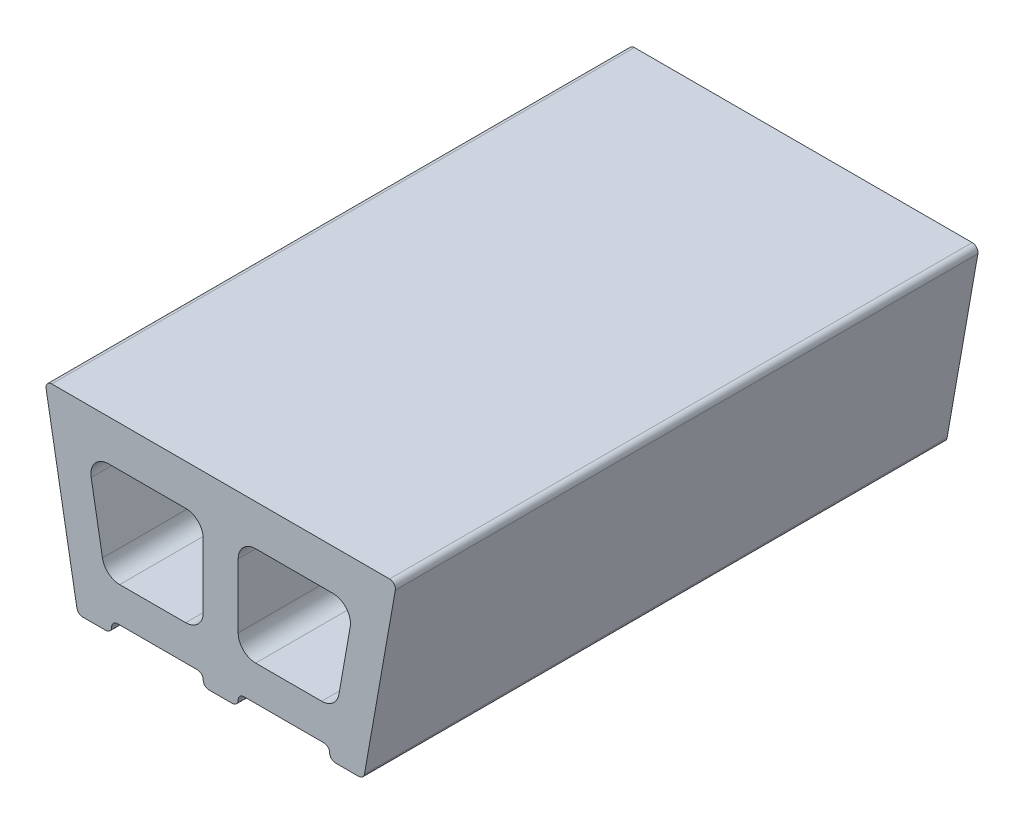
ISO-10303-21;
HEADER;
FILE_DESCRIPTION(('STEP AP214'),'2;1');
FILE_NAME('part.step','',(''),(''),'','','');
FILE_SCHEMA(('AUTOMOTIVE_DESIGN { 1 0 10303 214 1 1 1 1 }'));
ENDSEC;
DATA;
#1=APPLICATION_CONTEXT('core data for automotive mechanical design processes');
#2=APPLICATION_PROTOCOL_DEFINITION('international standard','automotive_design',2000,#1);
#3=PRODUCT_CONTEXT('',#1,'mechanical');
#4=PRODUCT('Part','Part','',(#3));
#5=PRODUCT_RELATED_PRODUCT_CATEGORY('part','',(#4));
#6=PRODUCT_DEFINITION_FORMATION('','',#4);
#7=PRODUCT_DEFINITION_CONTEXT('part definition',#1,'design');
#8=PRODUCT_DEFINITION('design','',#6,#7);
#9=PRODUCT_DEFINITION_SHAPE('','',#8);
#10=(LENGTH_UNIT() NAMED_UNIT(*) SI_UNIT(.MILLI.,.METRE.));
#11=(NAMED_UNIT(*) PLANE_ANGLE_UNIT() SI_UNIT($,.RADIAN.));
#12=(NAMED_UNIT(*) SI_UNIT($,.STERADIAN.) SOLID_ANGLE_UNIT());
#13=UNCERTAINTY_MEASURE_WITH_UNIT(LENGTH_MEASURE(1.E-05),#10,'distance_accuracy_value','');
#14=(GEOMETRIC_REPRESENTATION_CONTEXT(3) GLOBAL_UNCERTAINTY_ASSIGNED_CONTEXT((#13)) GLOBAL_UNIT_ASSIGNED_CONTEXT((#10,
#11,#12)) REPRESENTATION_CONTEXT('',''));
#15=CARTESIAN_POINT('',(0.,0.,0.));
#16=DIRECTION('',(0.,0.,1.));
#17=DIRECTION('',(1.,0.,0.));
#18=AXIS2_PLACEMENT_3D('',#15,#16,#17);
#19=CARTESIAN_POINT('',(0.,0.,500.));
#20=DIRECTION('',(0.,0.,-1.));
#21=DIRECTION('',(-1.,0.,0.));
#22=AXIS2_PLACEMENT_3D('',#19,#20,#21);
#23=PLANE('',#22);
#24=DIRECTION('',(1.,0.,0.));
#25=VECTOR('',#24,1.);
#26=CARTESIAN_POINT('',(93.5509528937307,-5.,500.));
#27=LINE('',#26,#25);
#28=CARTESIAN_POINT('',(98.5509528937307,-5.,500.));
#29=VERTEX_POINT('',#28);
#30=CARTESIAN_POINT('',(118.473819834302,-5.,500.));
#31=VERTEX_POINT('',#30);
#32=EDGE_CURVE('E519',#29,#31,#27,.T.);
#33=ORIENTED_EDGE('',*,*,#32,.T.);
#34=CARTESIAN_POINT('',(118.473819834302,0.,500.));
#35=DIRECTION('',(0.,0.,-1.));
#36=DIRECTION('',(-1.,0.,0.));
#37=AXIS2_PLACEMENT_3D('',#34,#35,#36);
#38=CIRCLE('',#37,5.);
#39=CARTESIAN_POINT('',(123.397858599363,-0.86824088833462,500.));
#40=VERTEX_POINT('',#39);
#41=EDGE_CURVE('E58',#31,#40,#38,.F.);
#42=ORIENTED_EDGE('',*,*,#41,.T.);
#43=DIRECTION('',(0.173648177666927,0.984807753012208,0.));
#44=VECTOR('',#43,1.);
#45=CARTESIAN_POINT('',(150.,150.,500.));
#46=LINE('',#45,#44);
#47=CARTESIAN_POINT('',(149.846905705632,149.131759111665,500.));
#48=VERTEX_POINT('',#47);
#49=EDGE_CURVE('E363',#40,#48,#46,.T.);
#50=ORIENTED_EDGE('',*,*,#49,.T.);
#51=CARTESIAN_POINT('',(144.922866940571,150.,500.));
#52=DIRECTION('',(0.,0.,-1.));
#53=DIRECTION('',(-1.,0.,0.));
#54=AXIS2_PLACEMENT_3D('',#51,#52,#53);
#55=CIRCLE('',#54,5.);
#56=CARTESIAN_POINT('',(144.922866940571,155.,500.));
#57=VERTEX_POINT('',#56);
#58=EDGE_CURVE('E467',#48,#57,#55,.F.);
#59=ORIENTED_EDGE('',*,*,#58,.T.);
#60=DIRECTION('',(-1.,0.,0.));
#61=VECTOR('',#60,1.);
#62=CARTESIAN_POINT('',(-150.881634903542,155.,500.));
#63=LINE('',#62,#61);
#64=CARTESIAN_POINT('',(-144.922866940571,155.,500.));
#65=VERTEX_POINT('',#64);
#66=EDGE_CURVE('E537',#57,#65,#63,.T.);
#67=ORIENTED_EDGE('',*,*,#66,.T.);
#68=CARTESIAN_POINT('',(-144.922866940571,150.,500.));
#69=DIRECTION('',(0.,0.,-1.));
#70=DIRECTION('',(-1.,0.,0.));
#71=AXIS2_PLACEMENT_3D('',#68,#69,#70);
#72=CIRCLE('',#71,5.);
#73=CARTESIAN_POINT('',(-149.846905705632,149.131759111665,500.));
#74=VERTEX_POINT('',#73);
#75=EDGE_CURVE('E465',#65,#74,#72,.F.);
#76=ORIENTED_EDGE('',*,*,#75,.T.);
#77=DIRECTION('',(0.173648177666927,-0.984807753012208,0.));
#78=VECTOR('',#77,1.);
#79=CARTESIAN_POINT('',(-123.550952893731,0.,500.));
#80=LINE('',#79,#78);
#81=CARTESIAN_POINT('',(-123.397858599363,-0.868240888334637,500.));
#82=VERTEX_POINT('',#81);
#83=EDGE_CURVE('E360',#74,#82,#80,.T.);
#84=ORIENTED_EDGE('',*,*,#83,.T.);
#85=CARTESIAN_POINT('',(-118.473819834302,0.,500.));
#86=DIRECTION('',(0.,0.,-1.));
#87=DIRECTION('',(-1.,0.,0.));
#88=AXIS2_PLACEMENT_3D('',#85,#86,#87);
#89=CIRCLE('',#88,5.);
#90=CARTESIAN_POINT('',(-118.473819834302,-5.,500.));
#91=VERTEX_POINT('',#90);
#92=EDGE_CURVE('E486',#82,#91,#89,.F.);
#93=ORIENTED_EDGE('',*,*,#92,.T.);
#94=DIRECTION('',(1.,0.,0.));
#95=VECTOR('',#94,1.);
#96=CARTESIAN_POINT('',(-122.669317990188,-5.,500.));
#97=LINE('',#96,#95);
#98=CARTESIAN_POINT('',(-98.5509528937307,-5.,500.));
#99=VERTEX_POINT('',#98);
#100=EDGE_CURVE('E531',#91,#99,#97,.T.);
#101=ORIENTED_EDGE('',*,*,#100,.T.);
#102=CARTESIAN_POINT('',(-98.5509528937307,0.,500.));
#103=DIRECTION('',(0.,0.,-1.));
#104=DIRECTION('',(-1.,0.,0.));
#105=AXIS2_PLACEMENT_3D('',#102,#103,#104);
#106=CIRCLE('',#105,5.);
#107=CARTESIAN_POINT('',(-93.5509528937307,0.,500.));
#108=VERTEX_POINT('',#107);
#109=EDGE_CURVE('E488',#99,#108,#106,.F.);
#110=ORIENTED_EDGE('',*,*,#109,.T.);
#111=CARTESIAN_POINT('',(-88.5509528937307,0.,500.));
#112=DIRECTION('',(0.,0.,-1.));
#113=DIRECTION('',(-1.,0.,0.));
#114=AXIS2_PLACEMENT_3D('',#111,#112,#113);
#115=CIRCLE('',#114,5.);
#116=CARTESIAN_POINT('',(-88.5509528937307,4.99999999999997,500.));
#117=VERTEX_POINT('',#116);
#118=EDGE_CURVE('E458',#108,#117,#115,.T.);
#119=ORIENTED_EDGE('',*,*,#118,.T.);
#120=DIRECTION('',(-1.,0.,0.));
#121=VECTOR('',#120,1.);
#122=CARTESIAN_POINT('',(-93.5509528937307,4.99999999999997,500.));
#123=LINE('',#122,#121);
#124=CARTESIAN_POINT('',(-20.,4.99999999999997,500.));
#125=VERTEX_POINT('',#124);
#126=EDGE_CURVE('E290',#125,#117,#123,.T.);
#127=ORIENTED_EDGE('',*,*,#126,.F.);
#128=CARTESIAN_POINT('',(-20.,0.,500.));
#129=DIRECTION('',(0.,0.,-1.));
#130=DIRECTION('',(-1.,0.,0.));
#131=AXIS2_PLACEMENT_3D('',#128,#129,#130);
#132=CIRCLE('',#131,5.);
#133=CARTESIAN_POINT('',(-15.,0.,500.));
#134=VERTEX_POINT('',#133);
#135=EDGE_CURVE('E453',#125,#134,#132,.T.);
#136=ORIENTED_EDGE('',*,*,#135,.T.);
#137=CARTESIAN_POINT('',(-10.,0.,500.));
#138=DIRECTION('',(0.,0.,-1.));
#139=DIRECTION('',(-1.,0.,0.));
#140=AXIS2_PLACEMENT_3D('',#137,#138,#139);
#141=CIRCLE('',#140,5.);
#142=CARTESIAN_POINT('',(-10.,-5.,500.));
#143=VERTEX_POINT('',#142);
#144=EDGE_CURVE('E502',#134,#143,#141,.F.);
#145=ORIENTED_EDGE('',*,*,#144,.T.);
#146=DIRECTION('',(1.,0.,0.));
#147=VECTOR('',#146,1.);
#148=CARTESIAN_POINT('',(-15.,-5.,500.));
#149=LINE('',#148,#147);
#150=CARTESIAN_POINT('',(10.,-5.,500.));
#151=VERTEX_POINT('',#150);
#152=EDGE_CURVE('E525',#143,#151,#149,.T.);
#153=ORIENTED_EDGE('',*,*,#152,.T.);
#154=CARTESIAN_POINT('',(10.,0.,500.));
#155=DIRECTION('',(0.,0.,-1.));
#156=DIRECTION('',(-1.,0.,0.));
#157=AXIS2_PLACEMENT_3D('',#154,#155,#156);
#158=CIRCLE('',#157,5.);
#159=CARTESIAN_POINT('',(15.,0.,500.));
#160=VERTEX_POINT('',#159);
#161=EDGE_CURVE('E504',#151,#160,#158,.F.);
#162=ORIENTED_EDGE('',*,*,#161,.T.);
#163=CARTESIAN_POINT('',(20.,0.,500.));
#164=DIRECTION('',(0.,0.,-1.));
#165=DIRECTION('',(-1.,0.,0.));
#166=AXIS2_PLACEMENT_3D('',#163,#164,#165);
#167=CIRCLE('',#166,5.);
#168=CARTESIAN_POINT('',(20.,4.99999999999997,500.));
#169=VERTEX_POINT('',#168);
#170=EDGE_CURVE('E285',#160,#169,#167,.T.);
#171=ORIENTED_EDGE('',*,*,#170,.T.);
#172=DIRECTION('',(-1.,0.,0.));
#173=VECTOR('',#172,1.);
#174=CARTESIAN_POINT('',(15.,4.99999999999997,500.));
#175=LINE('',#174,#173);
#176=CARTESIAN_POINT('',(88.5509528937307,4.99999999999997,500.));
#177=VERTEX_POINT('',#176);
#178=EDGE_CURVE('E300',#177,#169,#175,.T.);
#179=ORIENTED_EDGE('',*,*,#178,.F.);
#180=CARTESIAN_POINT('',(88.5509528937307,0.,500.));
#181=DIRECTION('',(0.,0.,-1.));
#182=DIRECTION('',(-1.,0.,0.));
#183=AXIS2_PLACEMENT_3D('',#180,#181,#182);
#184=CIRCLE('',#183,5.);
#185=CARTESIAN_POINT('',(93.5509528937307,0.,500.));
#186=VERTEX_POINT('',#185);
#187=EDGE_CURVE('E286',#177,#186,#184,.T.);
#188=ORIENTED_EDGE('',*,*,#187,.T.);
#189=CARTESIAN_POINT('',(98.5509528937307,0.,500.));
#190=DIRECTION('',(0.,0.,-1.));
#191=DIRECTION('',(-1.,0.,0.));
#192=AXIS2_PLACEMENT_3D('',#189,#190,#191);
#193=CIRCLE('',#192,5.);
#194=EDGE_CURVE('E288',#186,#29,#193,.F.);
#195=ORIENTED_EDGE('',*,*,#194,.T.);
#196=EDGE_LOOP('',(#33,#42,#50,#59,#67,#76,#84,#93,#101,#110,#119,#127,#136,#145,#153,#162,#171,
#179,#188,#195));
#197=FACE_BOUND('',#196,.T.);
#198=DIRECTION('',(1.,0.,0.));
#199=VECTOR('',#198,1.);
#200=CARTESIAN_POINT('',(-99.2595988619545,35.,500.));
#201=LINE('',#200,#199);
#202=CARTESIAN_POINT('',(-86.6731043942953,35.,500.));
#203=VERTEX_POINT('',#202);
#204=CARTESIAN_POINT('',(-30.,35.,500.));
#205=VERTEX_POINT('',#204);
#206=EDGE_CURVE('E352',#203,#205,#201,.T.);
#207=ORIENTED_EDGE('',*,*,#206,.F.);
#208=CARTESIAN_POINT('',(-86.6731043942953,50.,500.));
#209=DIRECTION('',(0.,0.,-1.));
#210=DIRECTION('',(-1.,0.,0.));
#211=AXIS2_PLACEMENT_3D('',#208,#209,#210);
#212=CIRCLE('',#211,15.);
#213=CARTESIAN_POINT('',(-101.445220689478,47.3952773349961,500.));
#214=VERTEX_POINT('',#213);
#215=EDGE_CURVE('E425',#203,#214,#212,.T.);
#216=ORIENTED_EDGE('',*,*,#215,.T.);
#217=DIRECTION('',(0.173648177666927,-0.984807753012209,0.));
#218=VECTOR('',#217,1.);
#219=CARTESIAN_POINT('',(-114.247392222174,120.,500.));
#220=LINE('',#219,#218);
#221=CARTESIAN_POINT('',(-111.143204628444,102.395277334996,500.));
#222=VERTEX_POINT('',#221);
#223=EDGE_CURVE('E325',#222,#214,#220,.T.);
#224=ORIENTED_EDGE('',*,*,#223,.F.);
#225=CARTESIAN_POINT('',(-96.3710883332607,105.,500.));
#226=DIRECTION('',(0.,0.,-1.));
#227=DIRECTION('',(-1.,0.,0.));
#228=AXIS2_PLACEMENT_3D('',#225,#226,#227);
#229=CIRCLE('',#228,15.);
#230=CARTESIAN_POINT('',(-96.3710883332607,120.,500.));
#231=VERTEX_POINT('',#230);
#232=EDGE_CURVE('E437',#222,#231,#229,.T.);
#233=ORIENTED_EDGE('',*,*,#232,.T.);
#234=DIRECTION('',(-1.,0.,0.));
#235=VECTOR('',#234,1.);
#236=CARTESIAN_POINT('',(-114.247392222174,120.,500.));
#237=LINE('',#236,#235);
#238=CARTESIAN_POINT('',(-30.,120.,500.));
#239=VERTEX_POINT('',#238);
#240=EDGE_CURVE('E340',#239,#231,#237,.T.);
#241=ORIENTED_EDGE('',*,*,#240,.F.);
#242=CARTESIAN_POINT('',(-30.,105.,500.));
#243=DIRECTION('',(0.,0.,-1.));
#244=DIRECTION('',(-1.,0.,0.));
#245=AXIS2_PLACEMENT_3D('',#242,#243,#244);
#246=CIRCLE('',#245,15.);
#247=CARTESIAN_POINT('',(-15.,105.,500.));
#248=VERTEX_POINT('',#247);
#249=EDGE_CURVE('E433',#239,#248,#246,.T.);
#250=ORIENTED_EDGE('',*,*,#249,.T.);
#251=DIRECTION('',(0.,1.,0.));
#252=VECTOR('',#251,1.);
#253=CARTESIAN_POINT('',(-15.,120.,500.));
#254=LINE('',#253,#252);
#255=CARTESIAN_POINT('',(-15.,50.,500.));
#256=VERTEX_POINT('',#255);
#257=EDGE_CURVE('E355',#256,#248,#254,.T.);
#258=ORIENTED_EDGE('',*,*,#257,.F.);
#259=CARTESIAN_POINT('',(-30.,50.,500.));
#260=DIRECTION('',(0.,0.,-1.));
#261=DIRECTION('',(-1.,0.,0.));
#262=AXIS2_PLACEMENT_3D('',#259,#260,#261);
#263=CIRCLE('',#262,15.);
#264=EDGE_CURVE('E429',#256,#205,#263,.T.);
#265=ORIENTED_EDGE('',*,*,#264,.T.);
#266=EDGE_LOOP('',(#207,#216,#224,#233,#241,#250,#258,#265));
#267=FACE_BOUND('',#266,.T.);
#268=DIRECTION('',(1.,0.,0.));
#269=VECTOR('',#268,1.);
#270=CARTESIAN_POINT('',(114.247392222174,120.,500.));
#271=LINE('',#270,#269);
#272=CARTESIAN_POINT('',(30.,120.,500.));
#273=VERTEX_POINT('',#272);
#274=CARTESIAN_POINT('',(96.3710883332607,120.,500.));
#275=VERTEX_POINT('',#274);
#276=EDGE_CURVE('E328',#273,#275,#271,.T.);
#277=ORIENTED_EDGE('',*,*,#276,.T.);
#278=CARTESIAN_POINT('',(96.3710883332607,105.,500.));
#279=DIRECTION('',(0.,0.,-1.));
#280=DIRECTION('',(-1.,0.,0.));
#281=AXIS2_PLACEMENT_3D('',#278,#279,#280);
#282=CIRCLE('',#281,15.);
#283=CARTESIAN_POINT('',(111.143204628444,102.395277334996,500.));
#284=VERTEX_POINT('',#283);
#285=EDGE_CURVE('E417',#275,#284,#282,.T.);
#286=ORIENTED_EDGE('',*,*,#285,.T.);
#287=DIRECTION('',(-0.173648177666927,-0.984807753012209,0.));
#288=VECTOR('',#287,1.);
#289=CARTESIAN_POINT('',(114.247392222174,120.,500.));
#290=LINE('',#289,#288);
#291=CARTESIAN_POINT('',(101.445220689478,47.3952773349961,500.));
#292=VERTEX_POINT('',#291);
#293=EDGE_CURVE('E309',#284,#292,#290,.T.);
#294=ORIENTED_EDGE('',*,*,#293,.T.);
#295=CARTESIAN_POINT('',(86.6731043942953,50.,500.));
#296=DIRECTION('',(0.,0.,-1.));
#297=DIRECTION('',(-1.,0.,0.));
#298=AXIS2_PLACEMENT_3D('',#295,#296,#297);
#299=CIRCLE('',#298,15.);
#300=CARTESIAN_POINT('',(86.6731043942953,35.,500.));
#301=VERTEX_POINT('',#300);
#302=EDGE_CURVE('E413',#292,#301,#299,.T.);
#303=ORIENTED_EDGE('',*,*,#302,.T.);
#304=DIRECTION('',(-1.,0.,0.));
#305=VECTOR('',#304,1.);
#306=CARTESIAN_POINT('',(99.2595988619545,35.,500.));
#307=LINE('',#306,#305);
#308=CARTESIAN_POINT('',(30.,35.,500.));
#309=VERTEX_POINT('',#308);
#310=EDGE_CURVE('E316',#301,#309,#307,.T.);
#311=ORIENTED_EDGE('',*,*,#310,.T.);
#312=CARTESIAN_POINT('',(30.,50.,500.));
#313=DIRECTION('',(0.,0.,-1.));
#314=DIRECTION('',(-1.,0.,0.));
#315=AXIS2_PLACEMENT_3D('',#312,#313,#314);
#316=CIRCLE('',#315,15.);
#317=CARTESIAN_POINT('',(15.,50.,500.));
#318=VERTEX_POINT('',#317);
#319=EDGE_CURVE('E409',#309,#318,#316,.T.);
#320=ORIENTED_EDGE('',*,*,#319,.T.);
#321=DIRECTION('',(0.,1.,0.));
#322=VECTOR('',#321,1.);
#323=CARTESIAN_POINT('',(15.,120.,500.));
#324=LINE('',#323,#322);
#325=CARTESIAN_POINT('',(15.,105.,500.));
#326=VERTEX_POINT('',#325);
#327=EDGE_CURVE('E331',#318,#326,#324,.T.);
#328=ORIENTED_EDGE('',*,*,#327,.T.);
#329=CARTESIAN_POINT('',(30.,105.,500.));
#330=DIRECTION('',(0.,0.,-1.));
#331=DIRECTION('',(-1.,0.,0.));
#332=AXIS2_PLACEMENT_3D('',#329,#330,#331);
#333=CIRCLE('',#332,15.);
#334=EDGE_CURVE('E421',#326,#273,#333,.T.);
#335=ORIENTED_EDGE('',*,*,#334,.T.);
#336=EDGE_LOOP('',(#277,#286,#294,#303,#311,#320,#328,#335));
#337=FACE_BOUND('',#336,.T.);
#338=ADVANCED_FACE('F35',(#197,#267,#337),#23,.F.);
#339=CARTESIAN_POINT('',(0.,0.,0.));
#340=DIRECTION('',(0.,0.,-1.));
#341=DIRECTION('',(-1.,0.,0.));
#342=AXIS2_PLACEMENT_3D('',#339,#340,#341);
#343=PLANE('',#342);
#344=DIRECTION('',(0.173648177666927,0.984807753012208,0.));
#345=VECTOR('',#344,1.);
#346=CARTESIAN_POINT('',(150.,150.,0.));
#347=LINE('',#346,#345);
#348=CARTESIAN_POINT('',(123.397858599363,-0.86824088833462,0.));
#349=VERTEX_POINT('',#348);
#350=CARTESIAN_POINT('',(149.846905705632,149.131759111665,0.));
#351=VERTEX_POINT('',#350);
#352=EDGE_CURVE('E364',#349,#351,#347,.T.);
#353=ORIENTED_EDGE('',*,*,#352,.F.);
#354=CARTESIAN_POINT('',(118.473819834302,0.,0.));
#355=DIRECTION('',(0.,0.,-1.));
#356=DIRECTION('',(-1.,0.,0.));
#357=AXIS2_PLACEMENT_3D('',#354,#355,#356);
#358=CIRCLE('',#357,5.);
#359=CARTESIAN_POINT('',(118.473819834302,-5.,0.));
#360=VERTEX_POINT('',#359);
#361=EDGE_CURVE('E11',#349,#360,#358,.T.);
#362=ORIENTED_EDGE('',*,*,#361,.T.);
#363=DIRECTION('',(1.,0.,0.));
#364=VECTOR('',#363,1.);
#365=CARTESIAN_POINT('',(93.5509528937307,-5.,0.));
#366=LINE('',#365,#364);
#367=CARTESIAN_POINT('',(98.5509528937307,-5.,0.));
#368=VERTEX_POINT('',#367);
#369=EDGE_CURVE('E274',#368,#360,#366,.T.);
#370=ORIENTED_EDGE('',*,*,#369,.F.);
#371=CARTESIAN_POINT('',(98.5509528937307,0.,0.));
#372=DIRECTION('',(0.,0.,-1.));
#373=DIRECTION('',(-1.,0.,0.));
#374=AXIS2_PLACEMENT_3D('',#371,#372,#373);
#375=CIRCLE('',#374,5.);
#376=CARTESIAN_POINT('',(93.5509528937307,0.,0.));
#377=VERTEX_POINT('',#376);
#378=EDGE_CURVE('E43',#368,#377,#375,.T.);
#379=ORIENTED_EDGE('',*,*,#378,.T.);
#380=CARTESIAN_POINT('',(88.5509528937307,0.,0.));
#381=DIRECTION('',(0.,0.,-1.));
#382=DIRECTION('',(-1.,0.,0.));
#383=AXIS2_PLACEMENT_3D('',#380,#381,#382);
#384=CIRCLE('',#383,5.);
#385=CARTESIAN_POINT('',(88.5509528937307,4.99999999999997,0.));
#386=VERTEX_POINT('',#385);
#387=EDGE_CURVE('E271',#377,#386,#384,.F.);
#388=ORIENTED_EDGE('',*,*,#387,.T.);
#389=DIRECTION('',(-1.,0.,0.));
#390=VECTOR('',#389,1.);
#391=CARTESIAN_POINT('',(15.,4.99999999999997,0.));
#392=LINE('',#391,#390);
#393=CARTESIAN_POINT('',(20.,4.99999999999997,0.));
#394=VERTEX_POINT('',#393);
#395=EDGE_CURVE('E297',#386,#394,#392,.T.);
#396=ORIENTED_EDGE('',*,*,#395,.T.);
#397=CARTESIAN_POINT('',(20.,0.,0.));
#398=DIRECTION('',(0.,0.,-1.));
#399=DIRECTION('',(-1.,0.,0.));
#400=AXIS2_PLACEMENT_3D('',#397,#398,#399);
#401=CIRCLE('',#400,5.);
#402=CARTESIAN_POINT('',(15.,0.,0.));
#403=VERTEX_POINT('',#402);
#404=EDGE_CURVE('E451',#394,#403,#401,.F.);
#405=ORIENTED_EDGE('',*,*,#404,.T.);
#406=CARTESIAN_POINT('',(10.,0.,0.));
#407=DIRECTION('',(0.,0.,-1.));
#408=DIRECTION('',(-1.,0.,0.));
#409=AXIS2_PLACEMENT_3D('',#406,#407,#408);
#410=CIRCLE('',#409,5.);
#411=CARTESIAN_POINT('',(10.,-5.,0.));
#412=VERTEX_POINT('',#411);
#413=EDGE_CURVE('E508',#403,#412,#410,.T.);
#414=ORIENTED_EDGE('',*,*,#413,.T.);
#415=DIRECTION('',(1.,0.,0.));
#416=VECTOR('',#415,1.);
#417=CARTESIAN_POINT('',(-15.,-5.,0.));
#418=LINE('',#417,#416);
#419=CARTESIAN_POINT('',(-10.,-5.,0.));
#420=VERTEX_POINT('',#419);
#421=EDGE_CURVE('E528',#420,#412,#418,.T.);
#422=ORIENTED_EDGE('',*,*,#421,.F.);
#423=CARTESIAN_POINT('',(-10.,0.,0.));
#424=DIRECTION('',(0.,0.,-1.));
#425=DIRECTION('',(-1.,0.,0.));
#426=AXIS2_PLACEMENT_3D('',#423,#424,#425);
#427=CIRCLE('',#426,5.);
#428=CARTESIAN_POINT('',(-15.,0.,0.));
#429=VERTEX_POINT('',#428);
#430=EDGE_CURVE('E506',#420,#429,#427,.T.);
#431=ORIENTED_EDGE('',*,*,#430,.T.);
#432=CARTESIAN_POINT('',(-20.,0.,0.));
#433=DIRECTION('',(0.,0.,-1.));
#434=DIRECTION('',(-1.,0.,0.));
#435=AXIS2_PLACEMENT_3D('',#432,#433,#434);
#436=CIRCLE('',#435,5.);
#437=CARTESIAN_POINT('',(-20.,4.99999999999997,0.));
#438=VERTEX_POINT('',#437);
#439=EDGE_CURVE('E456',#429,#438,#436,.F.);
#440=ORIENTED_EDGE('',*,*,#439,.T.);
#441=DIRECTION('',(-1.,0.,0.));
#442=VECTOR('',#441,1.);
#443=CARTESIAN_POINT('',(-93.5509528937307,4.99999999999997,0.));
#444=LINE('',#443,#442);
#445=CARTESIAN_POINT('',(-88.5509528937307,4.99999999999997,0.));
#446=VERTEX_POINT('',#445);
#447=EDGE_CURVE('E294',#438,#446,#444,.T.);
#448=ORIENTED_EDGE('',*,*,#447,.T.);
#449=CARTESIAN_POINT('',(-88.5509528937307,0.,0.));
#450=DIRECTION('',(0.,0.,-1.));
#451=DIRECTION('',(-1.,0.,0.));
#452=AXIS2_PLACEMENT_3D('',#449,#450,#451);
#453=CIRCLE('',#452,5.);
#454=CARTESIAN_POINT('',(-93.5509528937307,0.,0.));
#455=VERTEX_POINT('',#454);
#456=EDGE_CURVE('E460',#446,#455,#453,.F.);
#457=ORIENTED_EDGE('',*,*,#456,.T.);
#458=CARTESIAN_POINT('',(-98.5509528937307,0.,0.));
#459=DIRECTION('',(0.,0.,-1.));
#460=DIRECTION('',(-1.,0.,0.));
#461=AXIS2_PLACEMENT_3D('',#458,#459,#460);
#462=CIRCLE('',#461,5.);
#463=CARTESIAN_POINT('',(-98.5509528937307,-5.,0.));
#464=VERTEX_POINT('',#463);
#465=EDGE_CURVE('E492',#455,#464,#462,.T.);
#466=ORIENTED_EDGE('',*,*,#465,.T.);
#467=DIRECTION('',(1.,0.,0.));
#468=VECTOR('',#467,1.);
#469=CARTESIAN_POINT('',(-122.669317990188,-5.,0.));
#470=LINE('',#469,#468);
#471=CARTESIAN_POINT('',(-118.473819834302,-5.,0.));
#472=VERTEX_POINT('',#471);
#473=EDGE_CURVE('E534',#472,#464,#470,.T.);
#474=ORIENTED_EDGE('',*,*,#473,.F.);
#475=CARTESIAN_POINT('',(-118.473819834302,0.,0.));
#476=DIRECTION('',(0.,0.,-1.));
#477=DIRECTION('',(-1.,0.,0.));
#478=AXIS2_PLACEMENT_3D('',#475,#476,#477);
#479=CIRCLE('',#478,5.);
#480=CARTESIAN_POINT('',(-123.397858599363,-0.868240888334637,0.));
#481=VERTEX_POINT('',#480);
#482=EDGE_CURVE('E490',#472,#481,#479,.T.);
#483=ORIENTED_EDGE('',*,*,#482,.T.);
#484=DIRECTION('',(0.173648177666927,-0.984807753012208,0.));
#485=VECTOR('',#484,1.);
#486=CARTESIAN_POINT('',(-123.550952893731,0.,0.));
#487=LINE('',#486,#485);
#488=CARTESIAN_POINT('',(-149.846905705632,149.131759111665,0.));
#489=VERTEX_POINT('',#488);
#490=EDGE_CURVE('E349',#489,#481,#487,.T.);
#491=ORIENTED_EDGE('',*,*,#490,.F.);
#492=CARTESIAN_POINT('',(-144.922866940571,150.,0.));
#493=DIRECTION('',(0.,0.,-1.));
#494=DIRECTION('',(-1.,0.,0.));
#495=AXIS2_PLACEMENT_3D('',#492,#493,#494);
#496=CIRCLE('',#495,5.);
#497=CARTESIAN_POINT('',(-144.922866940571,155.,0.));
#498=VERTEX_POINT('',#497);
#499=EDGE_CURVE('E474',#489,#498,#496,.T.);
#500=ORIENTED_EDGE('',*,*,#499,.T.);
#501=DIRECTION('',(-1.,0.,0.));
#502=VECTOR('',#501,1.);
#503=CARTESIAN_POINT('',(-150.881634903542,155.,0.));
#504=LINE('',#503,#502);
#505=CARTESIAN_POINT('',(144.922866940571,155.,0.));
#506=VERTEX_POINT('',#505);
#507=EDGE_CURVE('E540',#506,#498,#504,.T.);
#508=ORIENTED_EDGE('',*,*,#507,.F.);
#509=CARTESIAN_POINT('',(144.922866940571,150.,0.));
#510=DIRECTION('',(0.,0.,-1.));
#511=DIRECTION('',(-1.,0.,0.));
#512=AXIS2_PLACEMENT_3D('',#509,#510,#511);
#513=CIRCLE('',#512,5.);
#514=EDGE_CURVE('E476',#506,#351,#513,.T.);
#515=ORIENTED_EDGE('',*,*,#514,.T.);
#516=EDGE_LOOP('',(#353,#362,#370,#379,#388,#396,#405,#414,#422,#431,#440,#448,#457,#466,#474,
#483,#491,#500,#508,#515));
#517=FACE_BOUND('',#516,.T.);
#518=DIRECTION('',(-1.,0.,0.));
#519=VECTOR('',#518,1.);
#520=CARTESIAN_POINT('',(-114.247392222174,120.,0.));
#521=LINE('',#520,#519);
#522=CARTESIAN_POINT('',(-30.,120.,0.));
#523=VERTEX_POINT('',#522);
#524=CARTESIAN_POINT('',(-96.3710883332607,120.,0.));
#525=VERTEX_POINT('',#524);
#526=EDGE_CURVE('E346',#523,#525,#521,.T.);
#527=ORIENTED_EDGE('',*,*,#526,.T.);
#528=CARTESIAN_POINT('',(-96.3710883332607,105.,0.));
#529=DIRECTION('',(0.,0.,-1.));
#530=DIRECTION('',(-1.,0.,0.));
#531=AXIS2_PLACEMENT_3D('',#528,#529,#530);
#532=CIRCLE('',#531,15.);
#533=CARTESIAN_POINT('',(-111.143204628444,102.395277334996,0.));
#534=VERTEX_POINT('',#533);
#535=EDGE_CURVE('E439',#525,#534,#532,.F.);
#536=ORIENTED_EDGE('',*,*,#535,.T.);
#537=DIRECTION('',(0.173648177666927,-0.984807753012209,0.));
#538=VECTOR('',#537,1.);
#539=CARTESIAN_POINT('',(-114.247392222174,120.,0.));
#540=LINE('',#539,#538);
#541=CARTESIAN_POINT('',(-101.445220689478,47.3952773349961,0.));
#542=VERTEX_POINT('',#541);
#543=EDGE_CURVE('E336',#534,#542,#540,.T.);
#544=ORIENTED_EDGE('',*,*,#543,.T.);
#545=CARTESIAN_POINT('',(-86.6731043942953,50.,0.));
#546=DIRECTION('',(0.,0.,-1.));
#547=DIRECTION('',(-1.,0.,0.));
#548=AXIS2_PLACEMENT_3D('',#545,#546,#547);
#549=CIRCLE('',#548,15.);
#550=CARTESIAN_POINT('',(-86.6731043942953,35.,0.));
#551=VERTEX_POINT('',#550);
#552=EDGE_CURVE('E427',#542,#551,#549,.F.);
#553=ORIENTED_EDGE('',*,*,#552,.T.);
#554=DIRECTION('',(1.,0.,0.));
#555=VECTOR('',#554,1.);
#556=CARTESIAN_POINT('',(-99.2595988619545,35.,0.));
#557=LINE('',#556,#555);
#558=CARTESIAN_POINT('',(-30.,35.,0.));
#559=VERTEX_POINT('',#558);
#560=EDGE_CURVE('E339',#551,#559,#557,.T.);
#561=ORIENTED_EDGE('',*,*,#560,.T.);
#562=CARTESIAN_POINT('',(-30.,50.,0.));
#563=DIRECTION('',(0.,0.,-1.));
#564=DIRECTION('',(-1.,0.,0.));
#565=AXIS2_PLACEMENT_3D('',#562,#563,#564);
#566=CIRCLE('',#565,15.);
#567=CARTESIAN_POINT('',(-15.,50.,0.));
#568=VERTEX_POINT('',#567);
#569=EDGE_CURVE('E431',#559,#568,#566,.F.);
#570=ORIENTED_EDGE('',*,*,#569,.T.);
#571=DIRECTION('',(0.,1.,0.));
#572=VECTOR('',#571,1.);
#573=CARTESIAN_POINT('',(-15.,120.,0.));
#574=LINE('',#573,#572);
#575=CARTESIAN_POINT('',(-15.,105.,0.));
#576=VERTEX_POINT('',#575);
#577=EDGE_CURVE('E343',#568,#576,#574,.T.);
#578=ORIENTED_EDGE('',*,*,#577,.T.);
#579=CARTESIAN_POINT('',(-30.,105.,0.));
#580=DIRECTION('',(0.,0.,-1.));
#581=DIRECTION('',(-1.,0.,0.));
#582=AXIS2_PLACEMENT_3D('',#579,#580,#581);
#583=CIRCLE('',#582,15.);
#584=EDGE_CURVE('E435',#576,#523,#583,.F.);
#585=ORIENTED_EDGE('',*,*,#584,.T.);
#586=EDGE_LOOP('',(#527,#536,#544,#553,#561,#570,#578,#585));
#587=FACE_BOUND('',#586,.T.);
#588=DIRECTION('',(-1.,0.,0.));
#589=VECTOR('',#588,1.);
#590=CARTESIAN_POINT('',(99.2595988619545,35.,0.));
#591=LINE('',#590,#589);
#592=CARTESIAN_POINT('',(86.6731043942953,35.,0.));
#593=VERTEX_POINT('',#592);
#594=CARTESIAN_POINT('',(30.,35.,0.));
#595=VERTEX_POINT('',#594);
#596=EDGE_CURVE('E322',#593,#595,#591,.T.);
#597=ORIENTED_EDGE('',*,*,#596,.F.);
#598=CARTESIAN_POINT('',(86.6731043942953,50.,0.));
#599=DIRECTION('',(0.,0.,-1.));
#600=DIRECTION('',(-1.,0.,0.));
#601=AXIS2_PLACEMENT_3D('',#598,#599,#600);
#602=CIRCLE('',#601,15.);
#603=CARTESIAN_POINT('',(101.445220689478,47.3952773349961,0.));
#604=VERTEX_POINT('',#603);
#605=EDGE_CURVE('E415',#593,#604,#602,.F.);
#606=ORIENTED_EDGE('',*,*,#605,.T.);
#607=DIRECTION('',(-0.173648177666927,-0.984807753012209,0.));
#608=VECTOR('',#607,1.);
#609=CARTESIAN_POINT('',(114.247392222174,120.,0.));
#610=LINE('',#609,#608);
#611=CARTESIAN_POINT('',(111.143204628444,102.395277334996,0.));
#612=VERTEX_POINT('',#611);
#613=EDGE_CURVE('E312',#612,#604,#610,.T.);
#614=ORIENTED_EDGE('',*,*,#613,.F.);
#615=CARTESIAN_POINT('',(96.3710883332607,105.,0.));
#616=DIRECTION('',(0.,0.,-1.));
#617=DIRECTION('',(-1.,0.,0.));
#618=AXIS2_PLACEMENT_3D('',#615,#616,#617);
#619=CIRCLE('',#618,15.);
#620=CARTESIAN_POINT('',(96.3710883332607,120.,0.));
#621=VERTEX_POINT('',#620);
#622=EDGE_CURVE('E419',#612,#621,#619,.F.);
#623=ORIENTED_EDGE('',*,*,#622,.T.);
#624=DIRECTION('',(1.,0.,0.));
#625=VECTOR('',#624,1.);
#626=CARTESIAN_POINT('',(114.247392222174,120.,0.));
#627=LINE('',#626,#625);
#628=CARTESIAN_POINT('',(30.,120.,0.));
#629=VERTEX_POINT('',#628);
#630=EDGE_CURVE('E315',#629,#621,#627,.T.);
#631=ORIENTED_EDGE('',*,*,#630,.F.);
#632=CARTESIAN_POINT('',(30.,105.,0.));
#633=DIRECTION('',(0.,0.,-1.));
#634=DIRECTION('',(-1.,0.,0.));
#635=AXIS2_PLACEMENT_3D('',#632,#633,#634);
#636=CIRCLE('',#635,15.);
#637=CARTESIAN_POINT('',(15.,105.,0.));
#638=VERTEX_POINT('',#637);
#639=EDGE_CURVE('E423',#629,#638,#636,.F.);
#640=ORIENTED_EDGE('',*,*,#639,.T.);
#641=DIRECTION('',(0.,1.,0.));
#642=VECTOR('',#641,1.);
#643=CARTESIAN_POINT('',(15.,120.,0.));
#644=LINE('',#643,#642);
#645=CARTESIAN_POINT('',(15.,50.,0.));
#646=VERTEX_POINT('',#645);
#647=EDGE_CURVE('E319',#646,#638,#644,.T.);
#648=ORIENTED_EDGE('',*,*,#647,.F.);
#649=CARTESIAN_POINT('',(30.,50.,0.));
#650=DIRECTION('',(0.,0.,-1.));
#651=DIRECTION('',(-1.,0.,0.));
#652=AXIS2_PLACEMENT_3D('',#649,#650,#651);
#653=CIRCLE('',#652,15.);
#654=EDGE_CURVE('E411',#646,#595,#653,.F.);
#655=ORIENTED_EDGE('',*,*,#654,.T.);
#656=EDGE_LOOP('',(#597,#606,#614,#623,#631,#640,#648,#655));
#657=FACE_BOUND('',#656,.T.);
#658=ADVANCED_FACE('F268',(#517,#587,#657),#343,.T.);
#659=CARTESIAN_POINT('',(-123.550952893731,0.,500.));
#660=DIRECTION('',(0.984807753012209,0.173648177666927,0.));
#661=DIRECTION('',(-0.173648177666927,0.984807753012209,0.));
#662=AXIS2_PLACEMENT_3D('',#659,#660,#661);
#663=PLANE('',#662);
#664=ORIENTED_EDGE('',*,*,#490,.T.);
#665=DIRECTION('',(0.,0.,1.));
#666=VECTOR('',#665,1.);
#667=CARTESIAN_POINT('',(-123.397858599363,-0.868240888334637,500.));
#668=LINE('',#667,#666);
#669=EDGE_CURVE('E494',#481,#82,#668,.T.);
#670=ORIENTED_EDGE('',*,*,#669,.T.);
#671=ORIENTED_EDGE('',*,*,#83,.F.);
#672=DIRECTION('',(0.,0.,1.));
#673=VECTOR('',#672,1.);
#674=CARTESIAN_POINT('',(-149.846905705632,149.131759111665,0.));
#675=LINE('',#674,#673);
#676=EDGE_CURVE('E479',#74,#489,#675,.F.);
#677=ORIENTED_EDGE('',*,*,#676,.T.);
#678=EDGE_LOOP('',(#664,#670,#671,#677));
#679=FACE_BOUND('',#678,.T.);
#680=ADVANCED_FACE('F596',(#679),#663,.F.);
#681=CARTESIAN_POINT('',(150.,150.,500.));
#682=DIRECTION('',(-0.984807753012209,0.173648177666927,0.));
#683=DIRECTION('',(-0.173648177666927,-0.984807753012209,0.));
#684=AXIS2_PLACEMENT_3D('',#681,#682,#683);
#685=PLANE('',#684);
#686=ORIENTED_EDGE('',*,*,#49,.F.);
#687=DIRECTION('',(0.,0.,1.));
#688=VECTOR('',#687,1.);
#689=CARTESIAN_POINT('',(123.397858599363,-0.868240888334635,0.));
#690=LINE('',#689,#688);
#691=EDGE_CURVE('E50',#40,#349,#690,.F.);
#692=ORIENTED_EDGE('',*,*,#691,.T.);
#693=ORIENTED_EDGE('',*,*,#352,.T.);
#694=DIRECTION('',(0.,0.,1.));
#695=VECTOR('',#694,1.);
#696=CARTESIAN_POINT('',(149.846905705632,149.131759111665,500.));
#697=LINE('',#696,#695);
#698=EDGE_CURVE('E462',#351,#48,#697,.T.);
#699=ORIENTED_EDGE('',*,*,#698,.T.);
#700=EDGE_LOOP('',(#686,#692,#693,#699));
#701=FACE_BOUND('',#700,.T.);
#702=ADVANCED_FACE('F631',(#701),#685,.F.);
#703=CARTESIAN_POINT('',(-114.247392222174,120.,0.));
#704=DIRECTION('',(-0.984807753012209,-0.173648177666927,0.));
#705=DIRECTION('',(0.173648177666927,-0.984807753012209,0.));
#706=AXIS2_PLACEMENT_3D('',#703,#704,#705);
#707=PLANE('',#706);
#708=ORIENTED_EDGE('',*,*,#223,.T.);
#709=DIRECTION('',(0.,0.,1.));
#710=VECTOR('',#709,1.);
#711=CARTESIAN_POINT('',(-101.445220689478,47.3952773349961,0.));
#712=LINE('',#711,#710);
#713=EDGE_CURVE('E397',#214,#542,#712,.F.);
#714=ORIENTED_EDGE('',*,*,#713,.T.);
#715=ORIENTED_EDGE('',*,*,#543,.F.);
#716=DIRECTION('',(0.,0.,1.));
#717=VECTOR('',#716,1.);
#718=CARTESIAN_POINT('',(-111.143204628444,102.395277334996,500.));
#719=LINE('',#718,#717);
#720=EDGE_CURVE('E394',#534,#222,#719,.T.);
#721=ORIENTED_EDGE('',*,*,#720,.T.);
#722=EDGE_LOOP('',(#708,#714,#715,#721));
#723=FACE_BOUND('',#722,.T.);
#724=ADVANCED_FACE('F628',(#723),#707,.F.);
#725=CARTESIAN_POINT('',(-114.247392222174,120.,0.));
#726=DIRECTION('',(0.,1.,0.));
#727=DIRECTION('',(0.,0.,1.));
#728=AXIS2_PLACEMENT_3D('',#725,#726,#727);
#729=PLANE('',#728);
#730=ORIENTED_EDGE('',*,*,#526,.F.);
#731=DIRECTION('',(0.,0.,1.));
#732=VECTOR('',#731,1.);
#733=CARTESIAN_POINT('',(-30.,120.,500.));
#734=LINE('',#733,#732);
#735=EDGE_CURVE('E406',#523,#239,#734,.T.);
#736=ORIENTED_EDGE('',*,*,#735,.T.);
#737=ORIENTED_EDGE('',*,*,#240,.T.);
#738=DIRECTION('',(0.,0.,1.));
#739=VECTOR('',#738,1.);
#740=CARTESIAN_POINT('',(-96.3710883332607,120.,0.));
#741=LINE('',#740,#739);
#742=EDGE_CURVE('E404',#231,#525,#741,.F.);
#743=ORIENTED_EDGE('',*,*,#742,.T.);
#744=EDGE_LOOP('',(#730,#736,#737,#743));
#745=FACE_BOUND('',#744,.T.);
#746=ADVANCED_FACE('F808',(#745),#729,.F.);
#747=CARTESIAN_POINT('',(-15.,120.,0.));
#748=DIRECTION('',(1.,0.,0.));
#749=DIRECTION('',(0.,1.,0.));
#750=AXIS2_PLACEMENT_3D('',#747,#748,#749);
#751=PLANE('',#750);
#752=ORIENTED_EDGE('',*,*,#577,.F.);
#753=DIRECTION('',(0.,0.,1.));
#754=VECTOR('',#753,1.);
#755=CARTESIAN_POINT('',(-15.,50.,500.));
#756=LINE('',#755,#754);
#757=EDGE_CURVE('E401',#568,#256,#756,.T.);
#758=ORIENTED_EDGE('',*,*,#757,.T.);
#759=ORIENTED_EDGE('',*,*,#257,.T.);
#760=DIRECTION('',(0.,0.,1.));
#761=VECTOR('',#760,1.);
#762=CARTESIAN_POINT('',(-15.,105.,0.));
#763=LINE('',#762,#761);
#764=EDGE_CURVE('E399',#248,#576,#763,.F.);
#765=ORIENTED_EDGE('',*,*,#764,.T.);
#766=EDGE_LOOP('',(#752,#758,#759,#765));
#767=FACE_BOUND('',#766,.T.);
#768=ADVANCED_FACE('F811',(#767),#751,.F.);
#769=CARTESIAN_POINT('',(-99.2595988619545,35.,0.));
#770=DIRECTION('',(0.,-1.,0.));
#771=DIRECTION('',(0.,0.,-1.));
#772=AXIS2_PLACEMENT_3D('',#769,#770,#771);
#773=PLANE('',#772);
#774=ORIENTED_EDGE('',*,*,#560,.F.);
#775=DIRECTION('',(0.,0.,1.));
#776=VECTOR('',#775,1.);
#777=CARTESIAN_POINT('',(-86.6731043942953,35.,500.));
#778=LINE('',#777,#776);
#779=EDGE_CURVE('E391',#551,#203,#778,.T.);
#780=ORIENTED_EDGE('',*,*,#779,.T.);
#781=ORIENTED_EDGE('',*,*,#206,.T.);
#782=DIRECTION('',(0.,0.,1.));
#783=VECTOR('',#782,1.);
#784=CARTESIAN_POINT('',(-30.,35.,0.));
#785=LINE('',#784,#783);
#786=EDGE_CURVE('E389',#205,#559,#785,.F.);
#787=ORIENTED_EDGE('',*,*,#786,.T.);
#788=EDGE_LOOP('',(#774,#780,#781,#787));
#789=FACE_BOUND('',#788,.T.);
#790=ADVANCED_FACE('F806',(#789),#773,.F.);
#791=CARTESIAN_POINT('',(114.247392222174,120.,0.));
#792=DIRECTION('',(-0.984807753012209,0.173648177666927,0.));
#793=DIRECTION('',(-0.173648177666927,-0.984807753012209,0.));
#794=AXIS2_PLACEMENT_3D('',#791,#792,#793);
#795=PLANE('',#794);
#796=ORIENTED_EDGE('',*,*,#613,.T.);
#797=DIRECTION('',(0.,0.,1.));
#798=VECTOR('',#797,1.);
#799=CARTESIAN_POINT('',(101.445220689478,47.3952773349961,500.));
#800=LINE('',#799,#798);
#801=EDGE_CURVE('E381',#604,#292,#800,.T.);
#802=ORIENTED_EDGE('',*,*,#801,.T.);
#803=ORIENTED_EDGE('',*,*,#293,.F.);
#804=DIRECTION('',(0.,0.,1.));
#805=VECTOR('',#804,1.);
#806=CARTESIAN_POINT('',(111.143204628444,102.395277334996,0.));
#807=LINE('',#806,#805);
#808=EDGE_CURVE('E379',#284,#612,#807,.F.);
#809=ORIENTED_EDGE('',*,*,#808,.T.);
#810=EDGE_LOOP('',(#796,#802,#803,#809));
#811=FACE_BOUND('',#810,.T.);
#812=ADVANCED_FACE('F796',(#811),#795,.T.);
#813=CARTESIAN_POINT('',(99.2595988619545,35.,0.));
#814=DIRECTION('',(0.,1.,0.));
#815=DIRECTION('',(0.,0.,1.));
#816=AXIS2_PLACEMENT_3D('',#813,#814,#815);
#817=PLANE('',#816);
#818=ORIENTED_EDGE('',*,*,#596,.T.);
#819=DIRECTION('',(0.,0.,1.));
#820=VECTOR('',#819,1.);
#821=CARTESIAN_POINT('',(30.,35.,500.));
#822=LINE('',#821,#820);
#823=EDGE_CURVE('E371',#595,#309,#822,.T.);
#824=ORIENTED_EDGE('',*,*,#823,.T.);
#825=ORIENTED_EDGE('',*,*,#310,.F.);
#826=DIRECTION('',(0.,0.,1.));
#827=VECTOR('',#826,1.);
#828=CARTESIAN_POINT('',(86.6731043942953,35.,0.));
#829=LINE('',#828,#827);
#830=EDGE_CURVE('E366',#301,#593,#829,.F.);
#831=ORIENTED_EDGE('',*,*,#830,.T.);
#832=EDGE_LOOP('',(#818,#824,#825,#831));
#833=FACE_BOUND('',#832,.T.);
#834=ADVANCED_FACE('F792',(#833),#817,.T.);
#835=CARTESIAN_POINT('',(15.,120.,0.));
#836=DIRECTION('',(1.,0.,0.));
#837=DIRECTION('',(0.,1.,0.));
#838=AXIS2_PLACEMENT_3D('',#835,#836,#837);
#839=PLANE('',#838);
#840=ORIENTED_EDGE('',*,*,#327,.F.);
#841=DIRECTION('',(0.,0.,1.));
#842=VECTOR('',#841,1.);
#843=CARTESIAN_POINT('',(15.,50.,0.));
#844=LINE('',#843,#842);
#845=EDGE_CURVE('E377',#318,#646,#844,.F.);
#846=ORIENTED_EDGE('',*,*,#845,.T.);
#847=ORIENTED_EDGE('',*,*,#647,.T.);
#848=DIRECTION('',(0.,0.,1.));
#849=VECTOR('',#848,1.);
#850=CARTESIAN_POINT('',(15.,105.,500.));
#851=LINE('',#850,#849);
#852=EDGE_CURVE('E374',#638,#326,#851,.T.);
#853=ORIENTED_EDGE('',*,*,#852,.T.);
#854=EDGE_LOOP('',(#840,#846,#847,#853));
#855=FACE_BOUND('',#854,.T.);
#856=ADVANCED_FACE('F795',(#855),#839,.T.);
#857=CARTESIAN_POINT('',(114.247392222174,120.,0.));
#858=DIRECTION('',(0.,-1.,0.));
#859=DIRECTION('',(0.,0.,-1.));
#860=AXIS2_PLACEMENT_3D('',#857,#858,#859);
#861=PLANE('',#860);
#862=ORIENTED_EDGE('',*,*,#630,.T.);
#863=DIRECTION('',(0.,0.,1.));
#864=VECTOR('',#863,1.);
#865=CARTESIAN_POINT('',(96.3710883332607,120.,500.));
#866=LINE('',#865,#864);
#867=EDGE_CURVE('E386',#621,#275,#866,.T.);
#868=ORIENTED_EDGE('',*,*,#867,.T.);
#869=ORIENTED_EDGE('',*,*,#276,.F.);
#870=DIRECTION('',(0.,0.,1.));
#871=VECTOR('',#870,1.);
#872=CARTESIAN_POINT('',(30.,120.,0.));
#873=LINE('',#872,#871);
#874=EDGE_CURVE('E384',#273,#629,#873,.F.);
#875=ORIENTED_EDGE('',*,*,#874,.T.);
#876=EDGE_LOOP('',(#862,#868,#869,#875));
#877=FACE_BOUND('',#876,.T.);
#878=ADVANCED_FACE('F640',(#877),#861,.T.);
#879=CARTESIAN_POINT('',(30.,50.,0.));
#880=DIRECTION('',(0.,0.,-1.));
#881=DIRECTION('',(-1.,0.,0.));
#882=AXIS2_PLACEMENT_3D('',#879,#880,#881);
#883=CYLINDRICAL_SURFACE('',#882,15.);
#884=ORIENTED_EDGE('',*,*,#654,.F.);
#885=ORIENTED_EDGE('',*,*,#845,.F.);
#886=ORIENTED_EDGE('',*,*,#319,.F.);
#887=ORIENTED_EDGE('',*,*,#823,.F.);
#888=EDGE_LOOP('',(#884,#885,#886,#887));
#889=FACE_BOUND('',#888,.T.);
#890=ADVANCED_FACE('F636',(#889),#883,.F.);
#891=CARTESIAN_POINT('',(86.6731043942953,50.,0.));
#892=DIRECTION('',(0.,0.,-1.));
#893=DIRECTION('',(-1.,0.,0.));
#894=AXIS2_PLACEMENT_3D('',#891,#892,#893);
#895=CYLINDRICAL_SURFACE('',#894,15.);
#896=ORIENTED_EDGE('',*,*,#605,.F.);
#897=ORIENTED_EDGE('',*,*,#830,.F.);
#898=ORIENTED_EDGE('',*,*,#302,.F.);
#899=ORIENTED_EDGE('',*,*,#801,.F.);
#900=EDGE_LOOP('',(#896,#897,#898,#899));
#901=FACE_BOUND('',#900,.T.);
#902=ADVANCED_FACE('F639',(#901),#895,.F.);
#903=CARTESIAN_POINT('',(96.3710883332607,105.,0.));
#904=DIRECTION('',(0.,0.,-1.));
#905=DIRECTION('',(-1.,0.,0.));
#906=AXIS2_PLACEMENT_3D('',#903,#904,#905);
#907=CYLINDRICAL_SURFACE('',#906,15.);
#908=ORIENTED_EDGE('',*,*,#622,.F.);
#909=ORIENTED_EDGE('',*,*,#808,.F.);
#910=ORIENTED_EDGE('',*,*,#285,.F.);
#911=ORIENTED_EDGE('',*,*,#867,.F.);
#912=EDGE_LOOP('',(#908,#909,#910,#911));
#913=FACE_BOUND('',#912,.T.);
#914=ADVANCED_FACE('F644',(#913),#907,.F.);
#915=CARTESIAN_POINT('',(30.,105.,0.));
#916=DIRECTION('',(0.,0.,-1.));
#917=DIRECTION('',(-1.,0.,0.));
#918=AXIS2_PLACEMENT_3D('',#915,#916,#917);
#919=CYLINDRICAL_SURFACE('',#918,15.);
#920=ORIENTED_EDGE('',*,*,#639,.F.);
#921=ORIENTED_EDGE('',*,*,#874,.F.);
#922=ORIENTED_EDGE('',*,*,#334,.F.);
#923=ORIENTED_EDGE('',*,*,#852,.F.);
#924=EDGE_LOOP('',(#920,#921,#922,#923));
#925=FACE_BOUND('',#924,.T.);
#926=ADVANCED_FACE('F648',(#925),#919,.F.);
#927=CARTESIAN_POINT('',(-86.6731043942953,50.,0.));
#928=DIRECTION('',(0.,0.,-1.));
#929=DIRECTION('',(-1.,0.,0.));
#930=AXIS2_PLACEMENT_3D('',#927,#928,#929);
#931=CYLINDRICAL_SURFACE('',#930,15.);
#932=ORIENTED_EDGE('',*,*,#552,.F.);
#933=ORIENTED_EDGE('',*,*,#713,.F.);
#934=ORIENTED_EDGE('',*,*,#215,.F.);
#935=ORIENTED_EDGE('',*,*,#779,.F.);
#936=EDGE_LOOP('',(#932,#933,#934,#935));
#937=FACE_BOUND('',#936,.T.);
#938=ADVANCED_FACE('F652',(#937),#931,.F.);
#939=CARTESIAN_POINT('',(-30.,50.,0.));
#940=DIRECTION('',(0.,0.,-1.));
#941=DIRECTION('',(-1.,0.,0.));
#942=AXIS2_PLACEMENT_3D('',#939,#940,#941);
#943=CYLINDRICAL_SURFACE('',#942,15.);
#944=ORIENTED_EDGE('',*,*,#569,.F.);
#945=ORIENTED_EDGE('',*,*,#786,.F.);
#946=ORIENTED_EDGE('',*,*,#264,.F.);
#947=ORIENTED_EDGE('',*,*,#757,.F.);
#948=EDGE_LOOP('',(#944,#945,#946,#947));
#949=FACE_BOUND('',#948,.T.);
#950=ADVANCED_FACE('F656',(#949),#943,.F.);
#951=CARTESIAN_POINT('',(-30.,105.,0.));
#952=DIRECTION('',(0.,0.,-1.));
#953=DIRECTION('',(-1.,0.,0.));
#954=AXIS2_PLACEMENT_3D('',#951,#952,#953);
#955=CYLINDRICAL_SURFACE('',#954,15.);
#956=ORIENTED_EDGE('',*,*,#584,.F.);
#957=ORIENTED_EDGE('',*,*,#764,.F.);
#958=ORIENTED_EDGE('',*,*,#249,.F.);
#959=ORIENTED_EDGE('',*,*,#735,.F.);
#960=EDGE_LOOP('',(#956,#957,#958,#959));
#961=FACE_BOUND('',#960,.T.);
#962=ADVANCED_FACE('F660',(#961),#955,.F.);
#963=CARTESIAN_POINT('',(-96.3710883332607,105.,0.));
#964=DIRECTION('',(0.,0.,-1.));
#965=DIRECTION('',(-1.,0.,0.));
#966=AXIS2_PLACEMENT_3D('',#963,#964,#965);
#967=CYLINDRICAL_SURFACE('',#966,15.);
#968=ORIENTED_EDGE('',*,*,#535,.F.);
#969=ORIENTED_EDGE('',*,*,#742,.F.);
#970=ORIENTED_EDGE('',*,*,#232,.F.);
#971=ORIENTED_EDGE('',*,*,#720,.F.);
#972=EDGE_LOOP('',(#968,#969,#970,#971));
#973=FACE_BOUND('',#972,.T.);
#974=ADVANCED_FACE('F664',(#973),#967,.F.);
#975=CARTESIAN_POINT('',(-93.5509528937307,4.99999999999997,0.));
#976=DIRECTION('',(0.,1.,0.));
#977=DIRECTION('',(0.,0.,1.));
#978=AXIS2_PLACEMENT_3D('',#975,#976,#977);
#979=PLANE('',#978);
#980=ORIENTED_EDGE('',*,*,#447,.F.);
#981=DIRECTION('',(0.,0.,1.));
#982=VECTOR('',#981,1.);
#983=CARTESIAN_POINT('',(-20.,4.99999999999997,500.));
#984=LINE('',#983,#982);
#985=EDGE_CURVE('E446',#438,#125,#984,.T.);
#986=ORIENTED_EDGE('',*,*,#985,.T.);
#987=ORIENTED_EDGE('',*,*,#126,.T.);
#988=DIRECTION('',(0.,0.,1.));
#989=VECTOR('',#988,1.);
#990=CARTESIAN_POINT('',(-88.5509528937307,4.99999999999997,0.));
#991=LINE('',#990,#989);
#992=EDGE_CURVE('E444',#117,#446,#991,.F.);
#993=ORIENTED_EDGE('',*,*,#992,.T.);
#994=EDGE_LOOP('',(#980,#986,#987,#993));
#995=FACE_BOUND('',#994,.T.);
#996=ADVANCED_FACE('F573',(#995),#979,.F.);
#997=CARTESIAN_POINT('',(15.,4.99999999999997,0.));
#998=DIRECTION('',(0.,1.,0.));
#999=DIRECTION('',(0.,0.,1.));
#1000=AXIS2_PLACEMENT_3D('',#997,#998,#999);
#1001=PLANE('',#1000);
#1002=ORIENTED_EDGE('',*,*,#395,.F.);
#1003=DIRECTION('',(0.,0.,1.));
#1004=VECTOR('',#1003,1.);
#1005=CARTESIAN_POINT('',(88.5509528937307,4.99999999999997,500.));
#1006=LINE('',#1005,#1004);
#1007=EDGE_CURVE('E284',#386,#177,#1006,.T.);
#1008=ORIENTED_EDGE('',*,*,#1007,.T.);
#1009=ORIENTED_EDGE('',*,*,#178,.T.);
#1010=DIRECTION('',(0.,0.,1.));
#1011=VECTOR('',#1010,1.);
#1012=CARTESIAN_POINT('',(20.,4.99999999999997,0.));
#1013=LINE('',#1012,#1011);
#1014=EDGE_CURVE('E441',#169,#394,#1013,.F.);
#1015=ORIENTED_EDGE('',*,*,#1014,.T.);
#1016=EDGE_LOOP('',(#1002,#1008,#1009,#1015));
#1017=FACE_BOUND('',#1016,.T.);
#1018=ADVANCED_FACE('F548',(#1017),#1001,.F.);
#1019=CARTESIAN_POINT('',(88.5509528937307,0.,0.));
#1020=DIRECTION('',(0.,0.,-1.));
#1021=DIRECTION('',(-1.,0.,0.));
#1022=AXIS2_PLACEMENT_3D('',#1019,#1020,#1021);
#1023=CYLINDRICAL_SURFACE('',#1022,5.);
#1024=ORIENTED_EDGE('',*,*,#387,.F.);
#1025=DIRECTION('',(0.,0.,1.));
#1026=VECTOR('',#1025,1.);
#1027=CARTESIAN_POINT('',(93.5509528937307,0.,0.));
#1028=LINE('',#1027,#1026);
#1029=EDGE_CURVE('E282',#377,#186,#1028,.T.);
#1030=ORIENTED_EDGE('',*,*,#1029,.T.);
#1031=ORIENTED_EDGE('',*,*,#187,.F.);
#1032=ORIENTED_EDGE('',*,*,#1007,.F.);
#1033=EDGE_LOOP('',(#1024,#1030,#1031,#1032));
#1034=FACE_BOUND('',#1033,.T.);
#1035=ADVANCED_FACE('F281',(#1034),#1023,.F.);
#1036=CARTESIAN_POINT('',(20.,0.,0.));
#1037=DIRECTION('',(0.,0.,-1.));
#1038=DIRECTION('',(-1.,0.,0.));
#1039=AXIS2_PLACEMENT_3D('',#1036,#1037,#1038);
#1040=CYLINDRICAL_SURFACE('',#1039,5.);
#1041=ORIENTED_EDGE('',*,*,#404,.F.);
#1042=ORIENTED_EDGE('',*,*,#1014,.F.);
#1043=ORIENTED_EDGE('',*,*,#170,.F.);
#1044=DIRECTION('',(0.,0.,1.));
#1045=VECTOR('',#1044,1.);
#1046=CARTESIAN_POINT('',(15.,0.,0.));
#1047=LINE('',#1046,#1045);
#1048=EDGE_CURVE('E291',#403,#160,#1047,.T.);
#1049=ORIENTED_EDGE('',*,*,#1048,.F.);
#1050=EDGE_LOOP('',(#1041,#1042,#1043,#1049));
#1051=FACE_BOUND('',#1050,.T.);
#1052=ADVANCED_FACE('F551',(#1051),#1040,.F.);
#1053=CARTESIAN_POINT('',(-20.,0.,0.));
#1054=DIRECTION('',(0.,0.,-1.));
#1055=DIRECTION('',(-1.,0.,0.));
#1056=AXIS2_PLACEMENT_3D('',#1053,#1054,#1055);
#1057=CYLINDRICAL_SURFACE('',#1056,5.);
#1058=ORIENTED_EDGE('',*,*,#439,.F.);
#1059=DIRECTION('',(0.,0.,1.));
#1060=VECTOR('',#1059,1.);
#1061=CARTESIAN_POINT('',(-15.,0.,0.));
#1062=LINE('',#1061,#1060);
#1063=EDGE_CURVE('E306',#429,#134,#1062,.T.);
#1064=ORIENTED_EDGE('',*,*,#1063,.T.);
#1065=ORIENTED_EDGE('',*,*,#135,.F.);
#1066=ORIENTED_EDGE('',*,*,#985,.F.);
#1067=EDGE_LOOP('',(#1058,#1064,#1065,#1066));
#1068=FACE_BOUND('',#1067,.T.);
#1069=ADVANCED_FACE('F570',(#1068),#1057,.F.);
#1070=CARTESIAN_POINT('',(-88.5509528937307,0.,0.));
#1071=DIRECTION('',(0.,0.,-1.));
#1072=DIRECTION('',(-1.,0.,0.));
#1073=AXIS2_PLACEMENT_3D('',#1070,#1071,#1072);
#1074=CYLINDRICAL_SURFACE('',#1073,5.);
#1075=ORIENTED_EDGE('',*,*,#456,.F.);
#1076=ORIENTED_EDGE('',*,*,#992,.F.);
#1077=ORIENTED_EDGE('',*,*,#118,.F.);
#1078=DIRECTION('',(0.,0.,1.));
#1079=VECTOR('',#1078,1.);
#1080=CARTESIAN_POINT('',(-93.5509528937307,0.,0.));
#1081=LINE('',#1080,#1079);
#1082=EDGE_CURVE('E304',#455,#108,#1081,.T.);
#1083=ORIENTED_EDGE('',*,*,#1082,.F.);
#1084=EDGE_LOOP('',(#1075,#1076,#1077,#1083));
#1085=FACE_BOUND('',#1084,.T.);
#1086=ADVANCED_FACE('F579',(#1085),#1074,.F.);
#1087=CARTESIAN_POINT('',(-150.881634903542,155.,0.));
#1088=DIRECTION('',(0.,1.,0.));
#1089=DIRECTION('',(-1.,0.,0.));
#1090=AXIS2_PLACEMENT_3D('',#1087,#1088,#1089);
#1091=PLANE('',#1090);
#1092=ORIENTED_EDGE('',*,*,#66,.F.);
#1093=DIRECTION('',(0.,0.,1.));
#1094=VECTOR('',#1093,1.);
#1095=CARTESIAN_POINT('',(144.922866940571,155.,0.));
#1096=LINE('',#1095,#1094);
#1097=EDGE_CURVE('E472',#57,#506,#1096,.F.);
#1098=ORIENTED_EDGE('',*,*,#1097,.T.);
#1099=ORIENTED_EDGE('',*,*,#507,.T.);
#1100=DIRECTION('',(0.,0.,1.));
#1101=VECTOR('',#1100,1.);
#1102=CARTESIAN_POINT('',(-144.922866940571,155.,500.));
#1103=LINE('',#1102,#1101);
#1104=EDGE_CURVE('E469',#498,#65,#1103,.T.);
#1105=ORIENTED_EDGE('',*,*,#1104,.T.);
#1106=EDGE_LOOP('',(#1092,#1098,#1099,#1105));
#1107=FACE_BOUND('',#1106,.T.);
#1108=ADVANCED_FACE('F606',(#1107),#1091,.T.);
#1109=CARTESIAN_POINT('',(144.922866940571,150.,500.));
#1110=DIRECTION('',(0.,0.,-1.));
#1111=DIRECTION('',(-1.,0.,0.));
#1112=AXIS2_PLACEMENT_3D('',#1109,#1110,#1111);
#1113=CYLINDRICAL_SURFACE('',#1112,5.);
#1114=ORIENTED_EDGE('',*,*,#514,.F.);
#1115=ORIENTED_EDGE('',*,*,#1097,.F.);
#1116=ORIENTED_EDGE('',*,*,#58,.F.);
#1117=ORIENTED_EDGE('',*,*,#698,.F.);
#1118=EDGE_LOOP('',(#1114,#1115,#1116,#1117));
#1119=FACE_BOUND('',#1118,.T.);
#1120=ADVANCED_FACE('F610',(#1119),#1113,.T.);
#1121=CARTESIAN_POINT('',(-144.922866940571,150.,0.));
#1122=DIRECTION('',(0.,0.,-1.));
#1123=DIRECTION('',(-1.,0.,0.));
#1124=AXIS2_PLACEMENT_3D('',#1121,#1122,#1123);
#1125=CYLINDRICAL_SURFACE('',#1124,5.);
#1126=ORIENTED_EDGE('',*,*,#499,.F.);
#1127=ORIENTED_EDGE('',*,*,#676,.F.);
#1128=ORIENTED_EDGE('',*,*,#75,.F.);
#1129=ORIENTED_EDGE('',*,*,#1104,.F.);
#1130=EDGE_LOOP('',(#1126,#1127,#1128,#1129));
#1131=FACE_BOUND('',#1130,.T.);
#1132=ADVANCED_FACE('F600',(#1131),#1125,.T.);
#1133=CARTESIAN_POINT('',(-122.669317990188,-5.,0.));
#1134=DIRECTION('',(0.,-1.,0.));
#1135=DIRECTION('',(1.,0.,0.));
#1136=AXIS2_PLACEMENT_3D('',#1133,#1134,#1135);
#1137=PLANE('',#1136);
#1138=ORIENTED_EDGE('',*,*,#473,.T.);
#1139=DIRECTION('',(0.,0.,1.));
#1140=VECTOR('',#1139,1.);
#1141=CARTESIAN_POINT('',(-98.5509528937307,-5.,0.));
#1142=LINE('',#1141,#1140);
#1143=EDGE_CURVE('E483',#464,#99,#1142,.T.);
#1144=ORIENTED_EDGE('',*,*,#1143,.T.);
#1145=ORIENTED_EDGE('',*,*,#100,.F.);
#1146=DIRECTION('',(0.,0.,1.));
#1147=VECTOR('',#1146,1.);
#1148=CARTESIAN_POINT('',(-118.473819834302,-5.,1.11022302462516E-13));
#1149=LINE('',#1148,#1147);
#1150=EDGE_CURVE('E481',#91,#472,#1149,.F.);
#1151=ORIENTED_EDGE('',*,*,#1150,.T.);
#1152=EDGE_LOOP('',(#1138,#1144,#1145,#1151));
#1153=FACE_BOUND('',#1152,.T.);
#1154=ADVANCED_FACE('F587',(#1153),#1137,.T.);
#1155=CARTESIAN_POINT('',(-15.,-5.,0.));
#1156=DIRECTION('',(0.,-1.,0.));
#1157=DIRECTION('',(0.,0.,-1.));
#1158=AXIS2_PLACEMENT_3D('',#1155,#1156,#1157);
#1159=PLANE('',#1158);
#1160=ORIENTED_EDGE('',*,*,#421,.T.);
#1161=DIRECTION('',(0.,0.,1.));
#1162=VECTOR('',#1161,1.);
#1163=CARTESIAN_POINT('',(10.,-5.,0.));
#1164=LINE('',#1163,#1162);
#1165=EDGE_CURVE('E499',#412,#151,#1164,.T.);
#1166=ORIENTED_EDGE('',*,*,#1165,.T.);
#1167=ORIENTED_EDGE('',*,*,#152,.F.);
#1168=DIRECTION('',(0.,0.,1.));
#1169=VECTOR('',#1168,1.);
#1170=CARTESIAN_POINT('',(-10.,-5.,0.));
#1171=LINE('',#1170,#1169);
#1172=EDGE_CURVE('E497',#143,#420,#1171,.F.);
#1173=ORIENTED_EDGE('',*,*,#1172,.T.);
#1174=EDGE_LOOP('',(#1160,#1166,#1167,#1173));
#1175=FACE_BOUND('',#1174,.T.);
#1176=ADVANCED_FACE('F559',(#1175),#1159,.T.);
#1177=CARTESIAN_POINT('',(93.5509528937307,-5.,0.));
#1178=DIRECTION('',(0.,-1.,0.));
#1179=DIRECTION('',(1.,0.,0.));
#1180=AXIS2_PLACEMENT_3D('',#1177,#1178,#1179);
#1181=PLANE('',#1180);
#1182=ORIENTED_EDGE('',*,*,#369,.T.);
#1183=DIRECTION('',(0.,0.,1.));
#1184=VECTOR('',#1183,1.);
#1185=CARTESIAN_POINT('',(118.473819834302,-5.,500.));
#1186=LINE('',#1185,#1184);
#1187=EDGE_CURVE('E512',#360,#31,#1186,.T.);
#1188=ORIENTED_EDGE('',*,*,#1187,.T.);
#1189=ORIENTED_EDGE('',*,*,#32,.F.);
#1190=DIRECTION('',(0.,0.,1.));
#1191=VECTOR('',#1190,1.);
#1192=CARTESIAN_POINT('',(98.5509528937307,-5.,0.));
#1193=LINE('',#1192,#1191);
#1194=EDGE_CURVE('E510',#29,#368,#1193,.F.);
#1195=ORIENTED_EDGE('',*,*,#1194,.T.);
#1196=EDGE_LOOP('',(#1182,#1188,#1189,#1195));
#1197=FACE_BOUND('',#1196,.T.);
#1198=ADVANCED_FACE('F522',(#1197),#1181,.T.);
#1199=CARTESIAN_POINT('',(-98.5509528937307,0.,0.));
#1200=DIRECTION('',(0.,0.,1.));
#1201=DIRECTION('',(1.,0.,0.));
#1202=AXIS2_PLACEMENT_3D('',#1199,#1200,#1201);
#1203=CYLINDRICAL_SURFACE('',#1202,5.);
#1204=ORIENTED_EDGE('',*,*,#465,.F.);
#1205=ORIENTED_EDGE('',*,*,#1082,.T.);
#1206=ORIENTED_EDGE('',*,*,#109,.F.);
#1207=ORIENTED_EDGE('',*,*,#1143,.F.);
#1208=EDGE_LOOP('',(#1204,#1205,#1206,#1207));
#1209=FACE_BOUND('',#1208,.T.);
#1210=ADVANCED_FACE('F582',(#1209),#1203,.T.);
#1211=CARTESIAN_POINT('',(-118.473819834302,0.,500.));
#1212=DIRECTION('',(0.,0.,-1.));
#1213=DIRECTION('',(-1.,0.,0.));
#1214=AXIS2_PLACEMENT_3D('',#1211,#1212,#1213);
#1215=CYLINDRICAL_SURFACE('',#1214,5.);
#1216=ORIENTED_EDGE('',*,*,#482,.F.);
#1217=ORIENTED_EDGE('',*,*,#1150,.F.);
#1218=ORIENTED_EDGE('',*,*,#92,.F.);
#1219=ORIENTED_EDGE('',*,*,#669,.F.);
#1220=EDGE_LOOP('',(#1216,#1217,#1218,#1219));
#1221=FACE_BOUND('',#1220,.T.);
#1222=ADVANCED_FACE('F591',(#1221),#1215,.T.);
#1223=CARTESIAN_POINT('',(10.,0.,0.));
#1224=DIRECTION('',(0.,0.,1.));
#1225=DIRECTION('',(1.,0.,0.));
#1226=AXIS2_PLACEMENT_3D('',#1223,#1224,#1225);
#1227=CYLINDRICAL_SURFACE('',#1226,5.);
#1228=ORIENTED_EDGE('',*,*,#413,.F.);
#1229=ORIENTED_EDGE('',*,*,#1048,.T.);
#1230=ORIENTED_EDGE('',*,*,#161,.F.);
#1231=ORIENTED_EDGE('',*,*,#1165,.F.);
#1232=EDGE_LOOP('',(#1228,#1229,#1230,#1231));
#1233=FACE_BOUND('',#1232,.T.);
#1234=ADVANCED_FACE('F562',(#1233),#1227,.T.);
#1235=CARTESIAN_POINT('',(-10.,0.,0.));
#1236=DIRECTION('',(0.,0.,1.));
#1237=DIRECTION('',(1.,0.,0.));
#1238=AXIS2_PLACEMENT_3D('',#1235,#1236,#1237);
#1239=CYLINDRICAL_SURFACE('',#1238,5.);
#1240=ORIENTED_EDGE('',*,*,#430,.F.);
#1241=ORIENTED_EDGE('',*,*,#1172,.F.);
#1242=ORIENTED_EDGE('',*,*,#144,.F.);
#1243=ORIENTED_EDGE('',*,*,#1063,.F.);
#1244=EDGE_LOOP('',(#1240,#1241,#1242,#1243));
#1245=FACE_BOUND('',#1244,.T.);
#1246=ADVANCED_FACE('F564',(#1245),#1239,.T.);
#1247=CARTESIAN_POINT('',(118.473819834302,0.,0.));
#1248=DIRECTION('',(0.,0.,-1.));
#1249=DIRECTION('',(-1.,0.,0.));
#1250=AXIS2_PLACEMENT_3D('',#1247,#1248,#1249);
#1251=CYLINDRICAL_SURFACE('',#1250,5.);
#1252=ORIENTED_EDGE('',*,*,#361,.F.);
#1253=ORIENTED_EDGE('',*,*,#691,.F.);
#1254=ORIENTED_EDGE('',*,*,#41,.F.);
#1255=ORIENTED_EDGE('',*,*,#1187,.F.);
#1256=EDGE_LOOP('',(#1252,#1253,#1254,#1255));
#1257=FACE_BOUND('',#1256,.T.);
#1258=ADVANCED_FACE('F614',(#1257),#1251,.T.);
#1259=CARTESIAN_POINT('',(98.5509528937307,0.,0.));
#1260=DIRECTION('',(0.,0.,1.));
#1261=DIRECTION('',(1.,0.,0.));
#1262=AXIS2_PLACEMENT_3D('',#1259,#1260,#1261);
#1263=CYLINDRICAL_SURFACE('',#1262,5.);
#1264=ORIENTED_EDGE('',*,*,#378,.F.);
#1265=ORIENTED_EDGE('',*,*,#1194,.F.);
#1266=ORIENTED_EDGE('',*,*,#194,.F.);
#1267=ORIENTED_EDGE('',*,*,#1029,.F.);
#1268=EDGE_LOOP('',(#1264,#1265,#1266,#1267));
#1269=FACE_BOUND('',#1268,.T.);
#1270=ADVANCED_FACE('F37',(#1269),#1263,.T.);
#1271=CLOSED_SHELL('',(#338,#658,#680,#702,#724,#746,#768,#790,#812,#834,#856,#878,#890,#902,
#914,#926,#938,#950,#962,#974,#996,#1018,#1035,#1052,#1069,#1086,#1108,#1120,#1132,#1154,#1176,
#1198,#1210,#1222,#1234,#1246,#1258,#1270));
#1272=MANIFOLD_SOLID_BREP('B2',#1271);
#1273=ADVANCED_BREP_SHAPE_REPRESENTATION('',(#18,#1272),#14);
#1274=SHAPE_DEFINITION_REPRESENTATION(#9,#1273);
ENDSEC;
END-ISO-10303-21;
